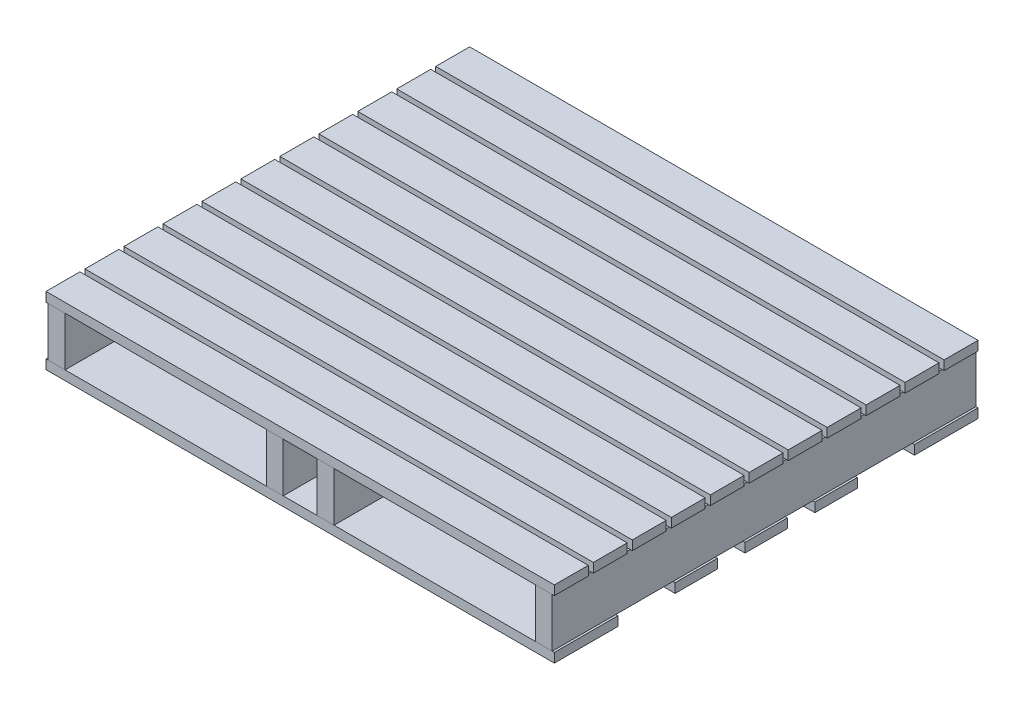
from build123d import *

# Parameters (mm, degrees)
SKETCH1_W              = 1200
SKETCH1_H              = 1000
BOSS_EXTRUDE1_DEPTH    = 22
SKETCH2_W              = 1200
SKETCH2_H              = 135
SKETCH2_H_2            = 65
CUT_EXTRUDE1_DEPTH     = 782.334755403
SKETCH3_W              = 40
SKETCH3_H              = 1000
BOSS_EXTRUDE2_DEPTH    = 116
BOSS_EXTRUDE2_2_DEPTH  = 116
BOSS_EXTRUDE2_3_DEPTH  = 116
BOSS_EXTRUDE2_4_DEPTH  = 116
SKETCH4_W              = 1200
SKETCH4_H              = 80
BOSS_EXTRUDE3_DEPTH    = 22
BOSS_EXTRUDE3_2_DEPTH  = 22
BOSS_EXTRUDE3_3_DEPTH  = 22
BOSS_EXTRUDE3_4_DEPTH  = 22
BOSS_EXTRUDE3_5_DEPTH  = 22
BOSS_EXTRUDE3_6_DEPTH  = 22
BOSS_EXTRUDE3_7_DEPTH  = 22
BOSS_EXTRUDE3_8_DEPTH  = 22
BOSS_EXTRUDE3_9_DEPTH  = 22
BOSS_EXTRUDE3_10_DEPTH = 22
BOSS_EXTRUDE3_11_DEPTH = 22


with BuildPart() as part:
    # Sketch1 → Boss-Extrude1 (new body)
    with BuildSketch(Plane(origin=(0, 0, 0), x_dir=(1, 0, 0), z_dir=(0, 1, 0))):
        Rectangle(SKETCH1_W, SKETCH1_H)
    extrude(amount=BOSS_EXTRUDE1_DEPTH)

    # Sketch2 → Cut-Extrude1 (cut, through all)
    with BuildSketch(Plane(origin=(0, 22, 0), x_dir=(1, 0, 0), z_dir=(0, 1, 0))):
        with Locations((0, 282.5)):
            Rectangle(SKETCH2_W, SKETCH2_H)
        with Locations((0, 82.5)):
            Rectangle(SKETCH2_W, SKETCH2_H_2)
        with Locations((0, -82.5)):
            Rectangle(SKETCH2_W, SKETCH2_H_2)
        with Locations((0, -282.5)):
            Rectangle(SKETCH2_W, SKETCH2_H)
    extrude(amount=-CUT_EXTRUDE1_DEPTH, mode=Mode.SUBTRACT)


with BuildPart() as cut_extrude1_piece_1:
    # of the separate pieces the step leaves, piece 1, a body of its own (cut_extrude1_pieces)
    add(part.part.solids().sort_by_distance((600, 0, 500))[0])


with BuildPart() as cut_extrude1_piece_2:
    # of the separate pieces the step leaves, piece 2, a body of its own (cut_extrude1_pieces)
    add(part.part.solids().sort_by_distance((600, 0, -500))[0])


with BuildPart() as cut_extrude1_piece_3:
    # of the separate pieces the step leaves, piece 3, a body of its own (cut_extrude1_pieces)
    add(part.part.solids().sort_by_distance((600, 0, -215))[0])


with BuildPart() as cut_extrude1_piece_4:
    # of the separate pieces the step leaves, piece 4, a body of its own (cut_extrude1_pieces)
    add(part.part.solids().sort_by_distance((600, 0, 115))[0])


with BuildPart() as cut_extrude1_piece_5:
    # of the separate pieces the step leaves, piece 5, a body of its own (cut_extrude1_pieces)
    add(part.part.solids().sort_by_distance((600, 0, -50))[0])


with BuildPart() as body_6:
    # Sketch3 → Boss-Extrude2 (new body)
    with BuildSketch(Plane(origin=(0, 22, 0), x_dir=(1, 0, 0), z_dir=(0, 1, 0))):
        with Locations((-575, 0)):
            Rectangle(SKETCH3_W, SKETCH3_H)
    extrude(amount=BOSS_EXTRUDE2_DEPTH)


with BuildPart() as body_7:
    # Sketch3 → Boss-Extrude2 2 (new body)
    with BuildSketch(Plane(origin=(0, 22, 0), x_dir=(1, 0, 0), z_dir=(0, 1, 0))):
        with Locations((575, 0)):
            Rectangle(SKETCH3_W, SKETCH3_H)
    extrude(amount=BOSS_EXTRUDE2_2_DEPTH)


with BuildPart() as body_8:
    # Sketch3 → Boss-Extrude2 3 (new body)
    with BuildSketch(Plane(origin=(0, 22, 0), x_dir=(1, 0, 0), z_dir=(0, 1, 0))):
        with Locations((-60, 0)):
            Rectangle(SKETCH3_W, SKETCH3_H)
    extrude(amount=BOSS_EXTRUDE2_3_DEPTH)


with BuildPart() as body_9:
    # Sketch3 → Boss-Extrude2 4 (new body)
    with BuildSketch(Plane(origin=(0, 22, 0), x_dir=(1, 0, 0), z_dir=(0, 1, 0))):
        with Locations((60, 0)):
            Rectangle(SKETCH3_W, SKETCH3_H)
    extrude(amount=BOSS_EXTRUDE2_4_DEPTH)


with BuildPart() as body_10:
    # Sketch4 → Boss-Extrude3 (new body)
    with BuildSketch(Plane(origin=(0, 138, 0), x_dir=(1, 0, 0), z_dir=(0, 1, 0))):
        with Locations((0, -368)):
            Rectangle(SKETCH4_W, SKETCH4_H)
    extrude(amount=BOSS_EXTRUDE3_DEPTH)


with BuildPart() as body_11:
    # Sketch4 → Boss-Extrude3 2 (new body)
    with BuildSketch(Plane(origin=(0, 138, 0), x_dir=(1, 0, 0), z_dir=(0, 1, 0))):
        with Locations((0, -460)):
            Rectangle(SKETCH4_W, SKETCH4_H)
    extrude(amount=BOSS_EXTRUDE3_2_DEPTH)


with BuildPart() as body_12:
    # Sketch4 → Boss-Extrude3 3 (new body)
    with BuildSketch(Plane(origin=(0, 138, 0), x_dir=(1, 0, 0), z_dir=(0, 1, 0))):
        with Locations((0, 460)):
            Rectangle(SKETCH4_W, SKETCH4_H)
    extrude(amount=BOSS_EXTRUDE3_3_DEPTH)


with BuildPart() as body_13:
    # Sketch4 → Boss-Extrude3 4 (new body)
    with BuildSketch(Plane(origin=(0, 138, 0), x_dir=(1, 0, 0), z_dir=(0, 1, 0))):
        with Locations((0, -276)):
            Rectangle(SKETCH4_W, SKETCH4_H)
    extrude(amount=BOSS_EXTRUDE3_4_DEPTH)


with BuildPart() as body_14:
    # Sketch4 → Boss-Extrude3 5 (new body)
    with BuildSketch(Plane(origin=(0, 138, 0), x_dir=(1, 0, 0), z_dir=(0, 1, 0))):
        with Locations((0, -184)):
            Rectangle(SKETCH4_W, SKETCH4_H)
    extrude(amount=BOSS_EXTRUDE3_5_DEPTH)


with BuildPart() as body_15:
    # Sketch4 → Boss-Extrude3 6 (new body)
    with BuildSketch(Plane(origin=(0, 138, 0), x_dir=(1, 0, 0), z_dir=(0, 1, 0))):
        with Locations((0, -92)):
            Rectangle(SKETCH4_W, SKETCH4_H)
    extrude(amount=BOSS_EXTRUDE3_6_DEPTH)


with BuildPart() as body_16:
    # Sketch4 → Boss-Extrude3 7 (new body)
    with BuildSketch(Plane(origin=(0, 138, 0), x_dir=(1, 0, 0), z_dir=(0, 1, 0))):
        Rectangle(SKETCH4_W, SKETCH4_H)
    extrude(amount=BOSS_EXTRUDE3_7_DEPTH)


with BuildPart() as body_17:
    # Sketch4 → Boss-Extrude3 8 (new body)
    with BuildSketch(Plane(origin=(0, 138, 0), x_dir=(1, 0, 0), z_dir=(0, 1, 0))):
        with Locations((0, 92)):
            Rectangle(SKETCH4_W, SKETCH4_H)
    extrude(amount=BOSS_EXTRUDE3_8_DEPTH)


with BuildPart() as body_18:
    # Sketch4 → Boss-Extrude3 9 (new body)
    with BuildSketch(Plane(origin=(0, 138, 0), x_dir=(1, 0, 0), z_dir=(0, 1, 0))):
        with Locations((0, 184)):
            Rectangle(SKETCH4_W, SKETCH4_H)
    extrude(amount=BOSS_EXTRUDE3_9_DEPTH)


with BuildPart() as body_19:
    # Sketch4 → Boss-Extrude3 10 (new body)
    with BuildSketch(Plane(origin=(0, 138, 0), x_dir=(1, 0, 0), z_dir=(0, 1, 0))):
        with Locations((0, 276)):
            Rectangle(SKETCH4_W, SKETCH4_H)
    extrude(amount=BOSS_EXTRUDE3_10_DEPTH)


with BuildPart() as body_20:
    # Sketch4 → Boss-Extrude3 11 (new body)
    with BuildSketch(Plane(origin=(0, 138, 0), x_dir=(1, 0, 0), z_dir=(0, 1, 0))):
        with Locations((0, 368)):
            Rectangle(SKETCH4_W, SKETCH4_H)
    extrude(amount=BOSS_EXTRUDE3_11_DEPTH)


solid = Compound([cut_extrude1_piece_1.part, cut_extrude1_piece_2.part, cut_extrude1_piece_3.part, cut_extrude1_piece_4.part, cut_extrude1_piece_5.part, body_6.part, body_7.part, body_8.part, body_9.part, body_10.part, body_11.part, body_12.part, body_13.part, body_14.part, body_15.part, body_16.part, body_17.part, body_18.part, body_19.part, body_20.part])
